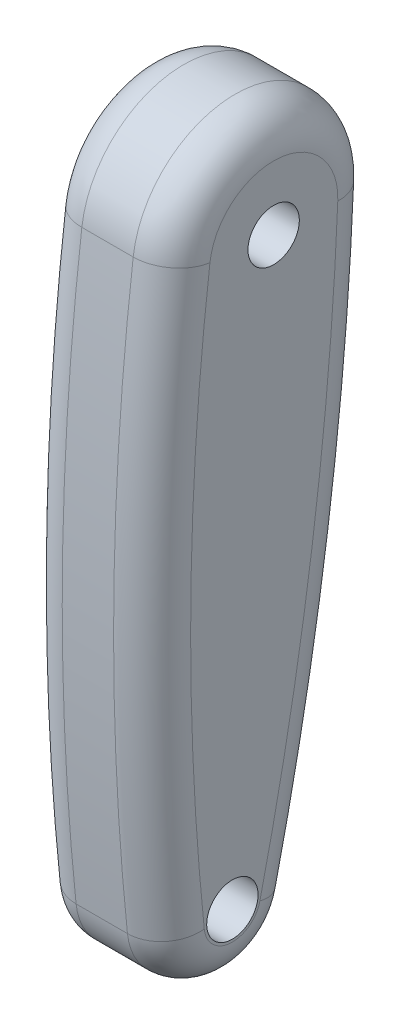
from build123d import *

# Parameters (mm, degrees)
BASE_EXTRUDE_DEPTH = 31.75
FILLET1_R          = 19.05
SKETCH6_R          = 12.7
CUT_EXTRUDE1_DEPTH = 412.480445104


with BuildPart() as part:
    # Sketch5 → Base-Extrude (new, symmetric)
    with BuildSketch(Plane.ZY.offset(-254)):
        with BuildLine():
            ThreePointArc((9.918396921, -78.230607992), (-44.703978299, -33.86975469), (-91.248408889, -86.643850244))
            ThreePointArc((-91.248408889, -86.643850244), (-78.432247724, -229.591476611), (-52.225916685, -370.69961275))
            ThreePointArc((-52.225916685, -370.69961275), (-17.988619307, -396.10195786), (12.760925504, -366.573375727))
            ThreePointArc((12.760925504, -366.573375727), (19.549821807, -222.321054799), (9.918396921, -78.230607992))
        make_face()
    extrude(amount=BASE_EXTRUDE_DEPTH, both=True)

    # Fillet1
    fillet1_edges = [part.edges().sort_by_distance(p)[0] for p in [
        (285.75, -229.591476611, -78.432247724),
        (222.25, -229.591476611, -78.432247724),
        (285.75, -33.86975469, -44.703978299),
        (222.25, -33.86975469, -44.703978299),
        (285.75, -222.321054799, 19.549821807),
        (222.25, -222.321054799, 19.549821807),
        (222.25, -396.10195786, -17.988619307),
        (285.75, -396.10195786, -17.988619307),
    ]]
    fillet(fillet1_edges, radius=FILLET1_R)

    # Sketch6 → Cut-Extrude1 (cut, through all)
    with BuildSketch(Plane(origin=(285.75, 0, 0), x_dir=(0, 0, -1), z_dir=(1, 0, 0))):
        with Locations(Location((40.493877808, -84.494995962, 0), (0, 0, 90))):
            Circle(SKETCH6_R)
        with Locations(Location((20.080958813, -363.148315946, 0), (0, 0, 90))):
            Circle(SKETCH6_R)
    extrude(amount=-CUT_EXTRUDE1_DEPTH, mode=Mode.SUBTRACT)


solid = part.part
